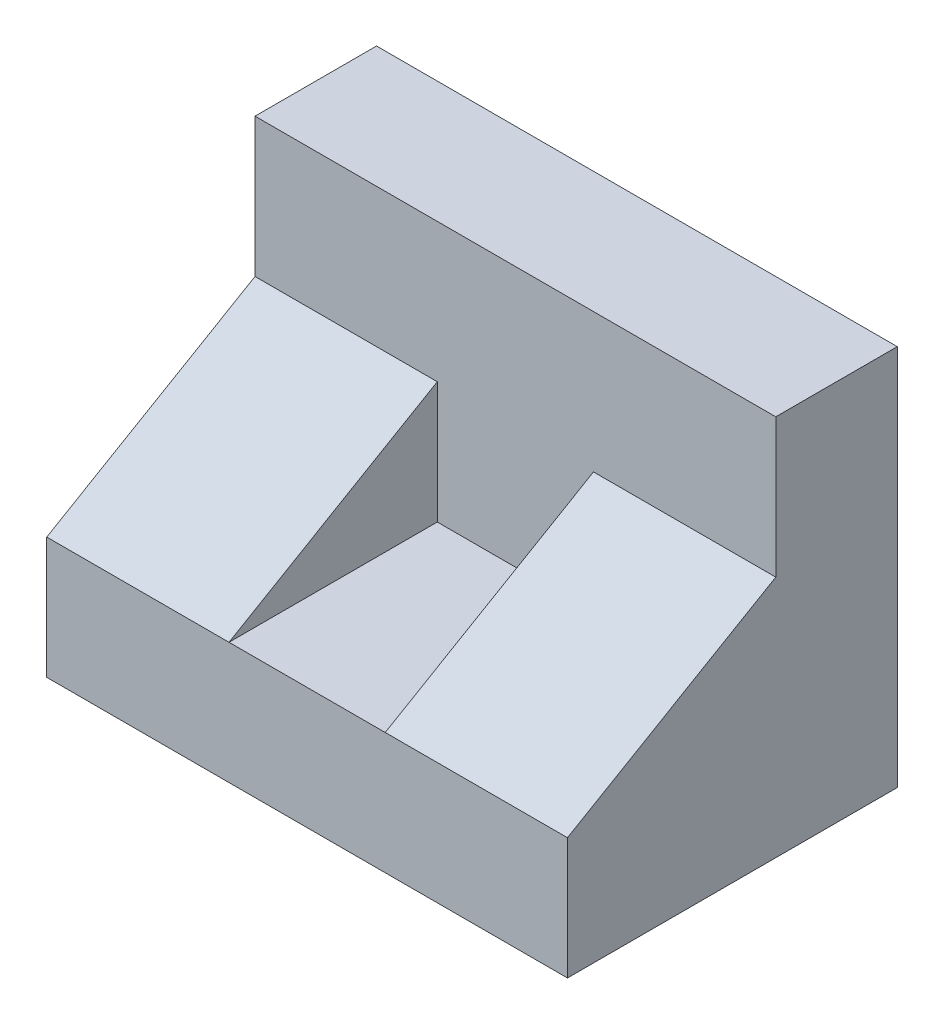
from build123d import *

# Parameters (mm, degrees)
EXTRUDE_1_DEPTH     = 15
CUT_EXTRUDE_1_DEPTH = 4.5


with BuildPart() as part:
    # Sketch 2 → Extrude 1 (new, symmetric)
    with BuildSketch(Plane(origin=(0, 0, 0), x_dir=(0, 0, -1), z_dir=(1, 0, 0))):
        Polygon((0, 0), (0, -22), (-19, -22), (-19, -15), (-7, -8), (-7, 0), align=None)
    extrude(amount=EXTRUDE_1_DEPTH, both=True)

    # Sketch 3 → Cut-Extrude 1 (cut, symmetric)
    with BuildSketch(Plane(origin=(0, 0, 0), x_dir=(0, 0, -1), z_dir=(1, 0, 0))):
        Polygon((-7, -8), (-7, -15), (-19, -15), align=None)
    extrude(amount=CUT_EXTRUDE_1_DEPTH, both=True, mode=Mode.SUBTRACT)


solid = part.part
